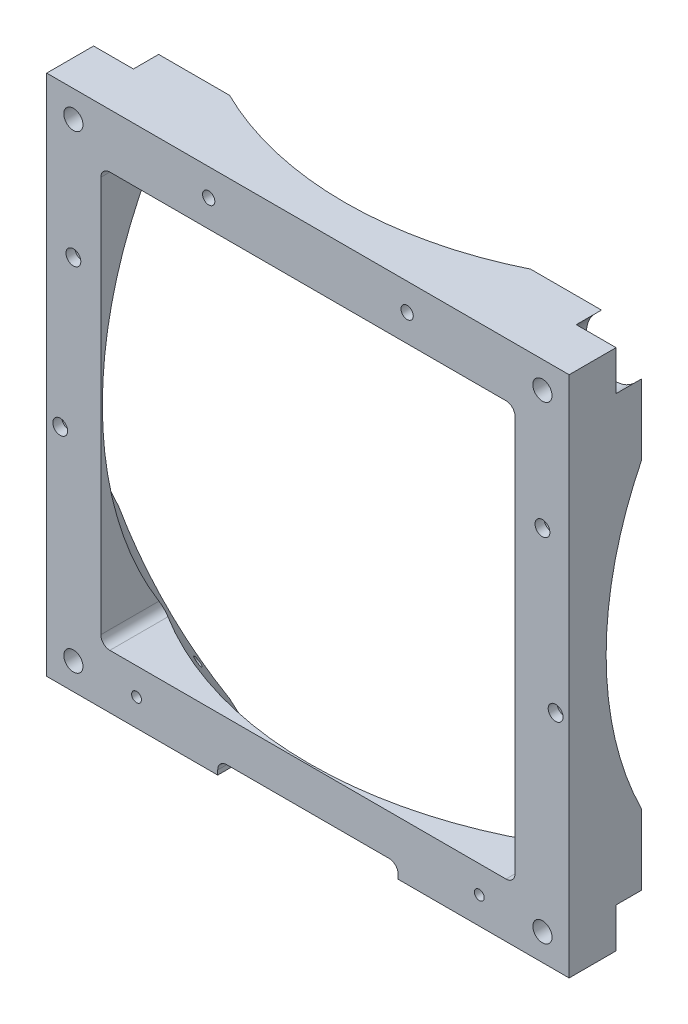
from build123d import *

# Parameters (mm, degrees)
SKETCH1_W             = 183.896
SKETCH1_H             = 183.896
SKETCH1_R             = 3.3782
SKETCH1_W_2           = 145.796
SKETCH1_H_2           = 145.796
EXTRUDE1_DEPTH        = 25.4
EXTRUDE29_DEPTH       = 8.89
F_8_32_TAPPED_HOLE1_D = 3.4544
SKETCH320_W           = 63.5
SKETCH320_H           = 60.065815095
EXTRUDE30_DEPTH       = 4.7625
F_10_START            = -3.175
SKETCH321_R           = 4.56438
F_10_SOCHD_DEPTH      = 22.225
SKETCH322_R           = 2.6162
CUT_EXTRUDE2_DEPTH    = 132.919748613
FILLET1_R             = 3.175
SKETCH323_R           = 2.159
CUT_EXTRUDE_6_DEPTH   = 133.491620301
F_6_START             = -3.175
SKETCH324_R           = 3.571875
F_6_CNTRBORE_DEPTH    = 22.225


with BuildPart() as part:
    # Sketch1 → Extrude1 (new body)
    with BuildSketch(Plane.XY):
        Rectangle(SKETCH1_W, SKETCH1_H)
        with Locations(Location((-82.55, 82.55, 0), (0, 0, 180))):
            Circle(SKETCH1_R, mode=Mode.SUBTRACT)
        with Locations(Location((82.55, -82.55, 0), (0, 0, 180))):
            Circle(SKETCH1_R, mode=Mode.SUBTRACT)
        with Locations(Location((82.55, 82.55, 0), (0, 0, 180))):
            Circle(SKETCH1_R, mode=Mode.SUBTRACT)
        with Locations(Location((-82.55, -82.55, 0), (0, 0, 180))):
            Circle(SKETCH1_R, mode=Mode.SUBTRACT)
        Rectangle(SKETCH1_W_2, SKETCH1_H_2, mode=Mode.SUBTRACT)
    extrude(amount=EXTRUDE1_DEPTH)

    # Sketch3 → Cut-Revolve1 (revolve, cut)
    with BuildSketch(Plane(origin=(0, 73.028485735, 0), x_dir=(0, 1, 0), z_dir=(1, 0, 0))):
        with BuildLine():
            Line((-223.840985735, -107.1626), (77.784014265, -107.1626))
            ThreePointArc((77.784014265, -107.1626), (-73.028485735, 43.6499), (-223.840985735, -107.1626))
        make_face()
    revolve(axis=Axis((0, -150.8125, -107.1626), (0, 1, 0)), mode=Mode.SUBTRACT)

    # Sketch50 → Extrude29 (cut)
    with BuildSketch(Plane(origin=(0, 0, 0), x_dir=(-1, 0, 0), z_dir=(0, 0, -1))):
        with BuildLine():
            Line((-124.590568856, -110.581369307), (-89.554599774, -75.545400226))
            ThreePointArc((-89.554599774, -75.545400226), (-75.545400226, -75.545400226), (-75.545400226, -89.554599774))
            Line((-75.545400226, -89.554599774), (-96.159923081, -110.169122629))
            Line((-96.159923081, -110.169122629), (-124.590568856, -110.581369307))
        make_face()
        with BuildLine():
            Line((106.837955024, 92.828755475), (89.554599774, 75.545400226))
            ThreePointArc((89.554599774, 75.545400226), (75.545400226, 75.545400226), (75.545400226, 89.554599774))
            Line((75.545400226, 89.554599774), (107.700942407, 121.710141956))
            Line((107.700942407, 121.710141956), (106.837955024, 92.828755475))
        make_face()
        with BuildLine():
            Line((-111.589813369, 97.58061382), (-89.554599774, 75.545400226))
            ThreePointArc((-89.554599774, 75.545400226), (-75.545400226, 75.545400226), (-75.545400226, 89.554599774))
            Line((-75.545400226, 89.554599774), (-94.8955969, 108.904796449))
            Line((-94.8955969, 108.904796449), (-111.589813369, 97.58061382))
        make_face()
        with BuildLine():
            Line((111.606219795, -97.597020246), (89.554599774, -75.545400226))
            ThreePointArc((89.554599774, -75.545400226), (75.545400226, -75.545400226), (75.545400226, -89.554599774))
            Line((75.545400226, -89.554599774), (89.073185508, -103.082385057))
            Line((89.073185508, -103.082385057), (111.606219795, -97.597020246))
        make_face()
    extrude(amount=-EXTRUDE29_DEPTH, mode=Mode.SUBTRACT)

    # 8-32 Tapped Hole1 (through all)
    with Locations(Plane.XY.offset(25.4)):
        with Locations((60.325, -82.423), (-60.325, -82.423)):
            Hole(F_8_32_TAPPED_HOLE1_D / 2)

    # Sketch320 → Extrude30 (cut)
    with BuildSketch(Plane.XZ.offset(91.948)):
        with Locations((0, 19.199906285)):
            Rectangle(SKETCH320_W, SKETCH320_H)
    extrude(amount=-EXTRUDE30_DEPTH, mode=Mode.SUBTRACT)

    # Sketch321 → 10 SocHd (cut)
    with BuildSketch(Plane.XY.offset(25.4).offset(F_10_START)):
        with Locations((-87.1855, -13.49375)):
            Circle(SKETCH321_R)
        with Locations((-82.55, 40.48125)):
            Circle(SKETCH321_R)
        with Locations((82.55, 40.48125)):
            Circle(SKETCH321_R)
        with Locations((87.1855, -13.49375)):
            Circle(SKETCH321_R)
    extrude(amount=-F_10_SOCHD_DEPTH, mode=Mode.SUBTRACT)

    # Sketch322 → Cut-Extrude2 (cut, through all)
    with BuildSketch(Plane(origin=(0, 0, 22.225), x_dir=(-1, 0, 0), z_dir=(0, 0, -1))):
        with Locations((82.55, 40.48125)):
            Circle(SKETCH322_R)
        with Locations((87.1855, -13.49375)):
            Circle(SKETCH322_R)
        with Locations((-87.1855, -13.49375)):
            Circle(SKETCH322_R)
        with Locations((-82.55, 40.48125)):
            Circle(SKETCH322_R)
    extrude(amount=-CUT_EXTRUDE2_DEPTH, mode=Mode.SUBTRACT)

    # Fillet1
    fillet1_edges = [part.edges().sort_by_distance(p)[0] for p in [
        (72.898, -72.898, 14.155445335),
        (72.898, 72.898, 14.155445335),
        (-72.898, 72.898, 14.155445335),
        (-31.75, -87.1855, 18.564129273),
        (31.75, -87.1855, 18.564129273),
        (-72.898, -72.898, 14.155445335),
    ]]
    fillet(fillet1_edges, radius=FILLET1_R)

    # Sketch323 → Cut-Extrude 6 (cut, through all)
    with BuildSketch(Plane.XY.offset(25.4)):
        with Locations((-34.925, 82.423)):
            Circle(SKETCH323_R)
        with Locations((34.925, 82.423)):
            Circle(SKETCH323_R)
    extrude(amount=-CUT_EXTRUDE_6_DEPTH, mode=Mode.SUBTRACT)

    # Sketch324 → 6 CntrBore (cut)
    with BuildSketch(Plane.XY.offset(25.4).offset(F_6_START)):
        with Locations((-34.925, 82.423)):
            Circle(SKETCH324_R)
        with Locations((34.925, 82.423)):
            Circle(SKETCH324_R)
    extrude(amount=-F_6_CNTRBORE_DEPTH, mode=Mode.SUBTRACT)


solid = part.part
